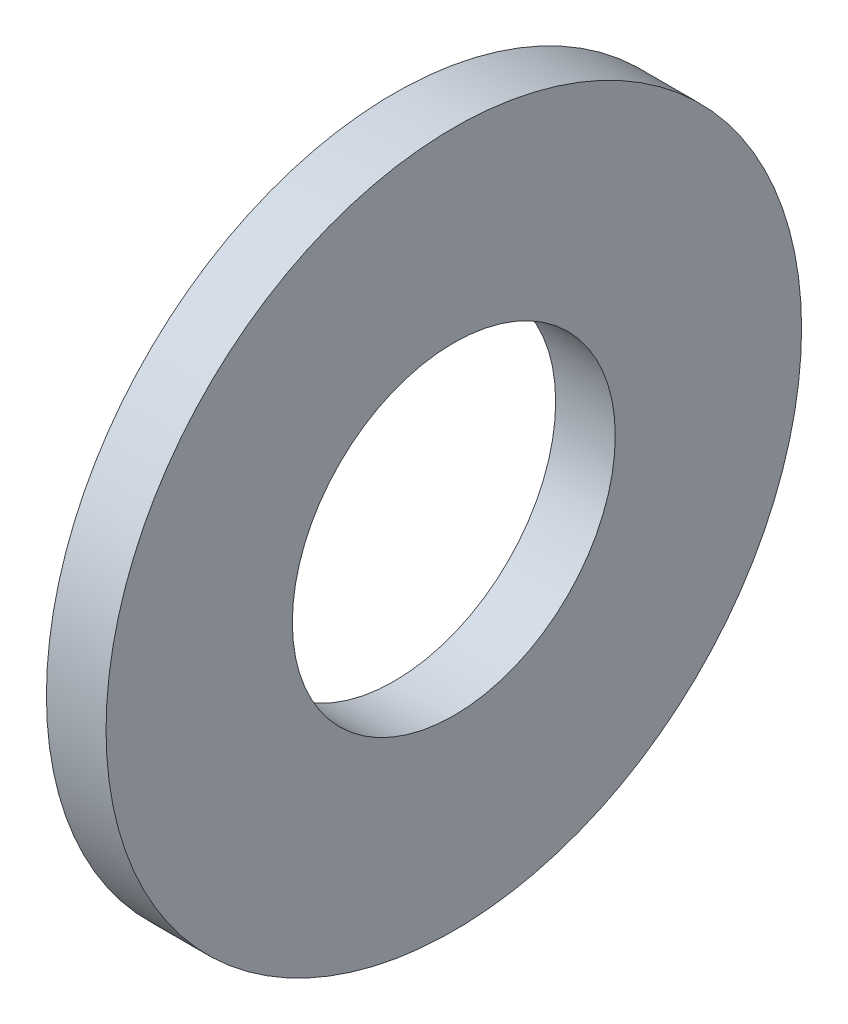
ISO-10303-21;
HEADER;
FILE_DESCRIPTION(('STEP AP214'),'2;1');
FILE_NAME('part.step','',(''),(''),'','','');
FILE_SCHEMA(('AUTOMOTIVE_DESIGN { 1 0 10303 214 1 1 1 1 }'));
ENDSEC;
DATA;
#1=APPLICATION_CONTEXT('core data for automotive mechanical design processes');
#2=APPLICATION_PROTOCOL_DEFINITION('international standard','automotive_design',2000,#1);
#3=PRODUCT_CONTEXT('',#1,'mechanical');
#4=PRODUCT('Part','Part','',(#3));
#5=PRODUCT_RELATED_PRODUCT_CATEGORY('part','',(#4));
#6=PRODUCT_DEFINITION_FORMATION('','',#4);
#7=PRODUCT_DEFINITION_CONTEXT('part definition',#1,'design');
#8=PRODUCT_DEFINITION('design','',#6,#7);
#9=PRODUCT_DEFINITION_SHAPE('','',#8);
#10=(LENGTH_UNIT() NAMED_UNIT(*) SI_UNIT(.MILLI.,.METRE.));
#11=(NAMED_UNIT(*) PLANE_ANGLE_UNIT() SI_UNIT($,.RADIAN.));
#12=(NAMED_UNIT(*) SI_UNIT($,.STERADIAN.) SOLID_ANGLE_UNIT());
#13=UNCERTAINTY_MEASURE_WITH_UNIT(LENGTH_MEASURE(1.E-05),#10,'distance_accuracy_value','');
#14=(GEOMETRIC_REPRESENTATION_CONTEXT(3) GLOBAL_UNCERTAINTY_ASSIGNED_CONTEXT((#13)) GLOBAL_UNIT_ASSIGNED_CONTEXT((#10,
#11,#12)) REPRESENTATION_CONTEXT('',''));
#15=CARTESIAN_POINT('',(0.,0.,0.));
#16=DIRECTION('',(0.,0.,1.));
#17=DIRECTION('',(1.,0.,0.));
#18=AXIS2_PLACEMENT_3D('',#15,#16,#17);
#19=CARTESIAN_POINT('',(1.2,0.,0.));
#20=DIRECTION('',(1.,0.,0.));
#21=DIRECTION('',(0.,0.,-1.));
#22=AXIS2_PLACEMENT_3D('',#19,#20,#21);
#23=PLANE('',#22);
#24=CARTESIAN_POINT('',(1.2,0.,0.));
#25=DIRECTION('',(1.,0.,0.));
#26=DIRECTION('',(0.,0.,-1.));
#27=AXIS2_PLACEMENT_3D('',#24,#25,#26);
#28=CIRCLE('',#27,3.25);
#29=CARTESIAN_POINT('',(1.2,0.,-3.25));
#30=VERTEX_POINT('',#29);
#31=EDGE_CURVE('E27',#30,#30,#28,.F.);
#32=ORIENTED_EDGE('',*,*,#31,.T.);
#33=EDGE_LOOP('',(#32));
#34=FACE_BOUND('',#33,.T.);
#35=CARTESIAN_POINT('',(1.2,0.,0.));
#36=DIRECTION('',(1.,0.,0.));
#37=DIRECTION('',(0.,0.,-1.));
#38=AXIS2_PLACEMENT_3D('',#35,#36,#37);
#39=CIRCLE('',#38,7.);
#40=CARTESIAN_POINT('',(1.2,0.,-7.));
#41=VERTEX_POINT('',#40);
#42=EDGE_CURVE('E18',#41,#41,#39,.F.);
#43=ORIENTED_EDGE('',*,*,#42,.F.);
#44=EDGE_LOOP('',(#43));
#45=FACE_BOUND('',#44,.T.);
#46=ADVANCED_FACE('F14',(#34,#45),#23,.T.);
#47=CARTESIAN_POINT('',(0.,0.,0.));
#48=DIRECTION('',(1.,0.,0.));
#49=DIRECTION('',(0.,0.,-1.));
#50=AXIS2_PLACEMENT_3D('',#47,#48,#49);
#51=CYLINDRICAL_SURFACE('',#50,7.);
#52=ORIENTED_EDGE('',*,*,#42,.T.);
#53=EDGE_LOOP('',(#52));
#54=FACE_BOUND('',#53,.T.);
#55=CARTESIAN_POINT('',(0.,0.,0.));
#56=DIRECTION('',(1.,0.,0.));
#57=DIRECTION('',(0.,0.,-1.));
#58=AXIS2_PLACEMENT_3D('',#55,#56,#57);
#59=CIRCLE('',#58,7.);
#60=CARTESIAN_POINT('',(0.,0.,-7.));
#61=VERTEX_POINT('',#60);
#62=EDGE_CURVE('E22',#61,#61,#59,.T.);
#63=ORIENTED_EDGE('',*,*,#62,.T.);
#64=EDGE_LOOP('',(#63));
#65=FACE_BOUND('',#64,.T.);
#66=ADVANCED_FACE('F35',(#54,#65),#51,.T.);
#67=CARTESIAN_POINT('',(0.,0.,0.));
#68=DIRECTION('',(1.,0.,0.));
#69=DIRECTION('',(0.,0.,-1.));
#70=AXIS2_PLACEMENT_3D('',#67,#68,#69);
#71=CYLINDRICAL_SURFACE('',#70,3.25);
#72=ORIENTED_EDGE('',*,*,#31,.F.);
#73=EDGE_LOOP('',(#72));
#74=FACE_BOUND('',#73,.T.);
#75=CARTESIAN_POINT('',(0.,0.,0.));
#76=DIRECTION('',(1.,0.,0.));
#77=DIRECTION('',(0.,0.,-1.));
#78=AXIS2_PLACEMENT_3D('',#75,#76,#77);
#79=CIRCLE('',#78,3.25);
#80=CARTESIAN_POINT('',(0.,0.,-3.25));
#81=VERTEX_POINT('',#80);
#82=EDGE_CURVE('E10',#81,#81,#79,.F.);
#83=ORIENTED_EDGE('',*,*,#82,.T.);
#84=EDGE_LOOP('',(#83));
#85=FACE_BOUND('',#84,.T.);
#86=ADVANCED_FACE('F44',(#74,#85),#71,.F.);
#87=CARTESIAN_POINT('',(0.,0.,0.));
#88=DIRECTION('',(1.,0.,0.));
#89=DIRECTION('',(0.,0.,-1.));
#90=AXIS2_PLACEMENT_3D('',#87,#88,#89);
#91=PLANE('',#90);
#92=ORIENTED_EDGE('',*,*,#82,.F.);
#93=EDGE_LOOP('',(#92));
#94=FACE_BOUND('',#93,.T.);
#95=ORIENTED_EDGE('',*,*,#62,.F.);
#96=EDGE_LOOP('',(#95));
#97=FACE_BOUND('',#96,.T.);
#98=ADVANCED_FACE('F16',(#94,#97),#91,.F.);
#99=CLOSED_SHELL('',(#46,#66,#86,#98));
#100=MANIFOLD_SOLID_BREP('B1',#99);
#101=ADVANCED_BREP_SHAPE_REPRESENTATION('',(#18,#100),#14);
#102=SHAPE_DEFINITION_REPRESENTATION(#9,#101);
ENDSEC;
END-ISO-10303-21;
